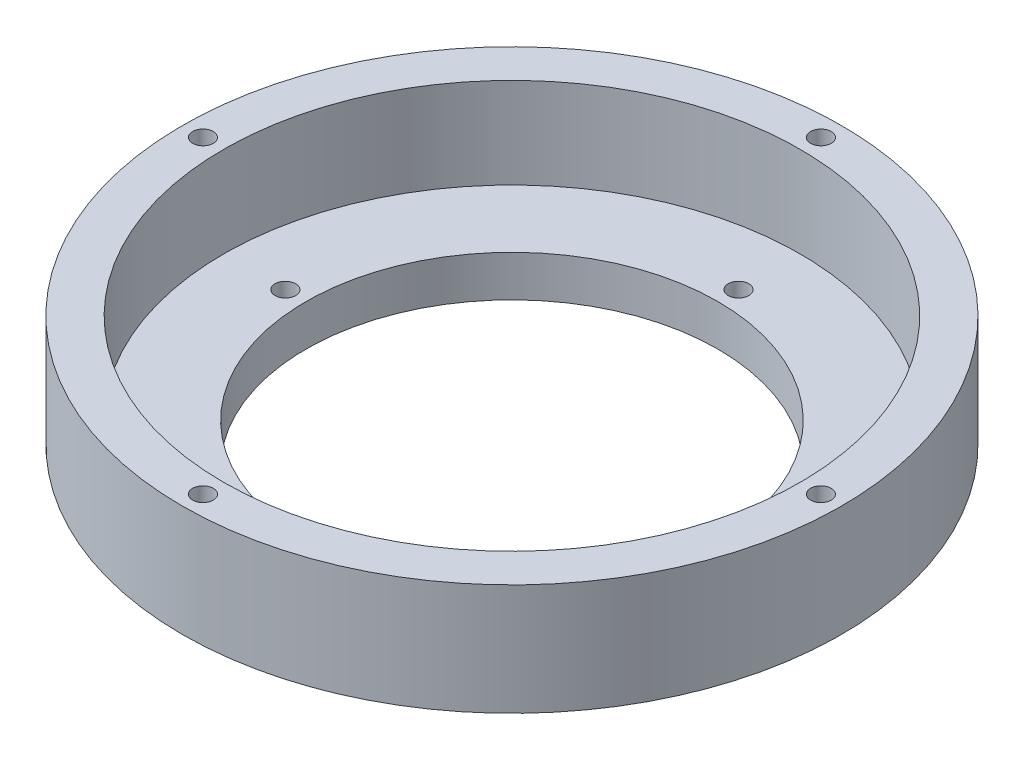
ISO-10303-21;
HEADER;
FILE_DESCRIPTION(('STEP AP214'),'2;1');
FILE_NAME('part.step','',(''),(''),'','','');
FILE_SCHEMA(('AUTOMOTIVE_DESIGN { 1 0 10303 214 1 1 1 1 }'));
ENDSEC;
DATA;
#1=APPLICATION_CONTEXT('core data for automotive mechanical design processes');
#2=APPLICATION_PROTOCOL_DEFINITION('international standard','automotive_design',2000,#1);
#3=PRODUCT_CONTEXT('',#1,'mechanical');
#4=PRODUCT('Part','Part','',(#3));
#5=PRODUCT_RELATED_PRODUCT_CATEGORY('part','',(#4));
#6=PRODUCT_DEFINITION_FORMATION('','',#4);
#7=PRODUCT_DEFINITION_CONTEXT('part definition',#1,'design');
#8=PRODUCT_DEFINITION('design','',#6,#7);
#9=PRODUCT_DEFINITION_SHAPE('','',#8);
#10=(LENGTH_UNIT() NAMED_UNIT(*) SI_UNIT(.MILLI.,.METRE.));
#11=(NAMED_UNIT(*) PLANE_ANGLE_UNIT() SI_UNIT($,.RADIAN.));
#12=(NAMED_UNIT(*) SI_UNIT($,.STERADIAN.) SOLID_ANGLE_UNIT());
#13=UNCERTAINTY_MEASURE_WITH_UNIT(LENGTH_MEASURE(1.E-05),#10,'distance_accuracy_value','');
#14=(GEOMETRIC_REPRESENTATION_CONTEXT(3) GLOBAL_UNCERTAINTY_ASSIGNED_CONTEXT((#13)) GLOBAL_UNIT_ASSIGNED_CONTEXT((#10,
#11,#12)) REPRESENTATION_CONTEXT('',''));
#15=CARTESIAN_POINT('',(0.,0.,0.));
#16=DIRECTION('',(0.,0.,1.));
#17=DIRECTION('',(1.,0.,0.));
#18=AXIS2_PLACEMENT_3D('',#15,#16,#17);
#19=CARTESIAN_POINT('',(0.,10.,0.));
#20=DIRECTION('',(0.,1.,0.));
#21=DIRECTION('',(0.,0.,1.));
#22=AXIS2_PLACEMENT_3D('',#19,#20,#21);
#23=PLANE('',#22);
#24=CARTESIAN_POINT('',(-55.,10.,0.));
#25=DIRECTION('',(0.,1.,0.));
#26=DIRECTION('',(0.,0.,1.));
#27=AXIS2_PLACEMENT_3D('',#24,#25,#26);
#28=CIRCLE('',#27,2.5);
#29=CARTESIAN_POINT('',(-55.,10.,2.5));
#30=VERTEX_POINT('',#29);
#31=EDGE_CURVE('E85',#30,#30,#28,.F.);
#32=ORIENTED_EDGE('',*,*,#31,.T.);
#33=EDGE_LOOP('',(#32));
#34=FACE_BOUND('',#33,.T.);
#35=CARTESIAN_POINT('',(1.94289029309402E-13,10.,55.));
#36=DIRECTION('',(0.,1.,0.));
#37=DIRECTION('',(0.,0.,1.));
#38=AXIS2_PLACEMENT_3D('',#35,#36,#37);
#39=CIRCLE('',#38,2.5);
#40=CARTESIAN_POINT('',(1.94289029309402E-13,10.,57.5));
#41=VERTEX_POINT('',#40);
#42=EDGE_CURVE('E79',#41,#41,#39,.F.);
#43=ORIENTED_EDGE('',*,*,#42,.T.);
#44=EDGE_LOOP('',(#43));
#45=FACE_BOUND('',#44,.T.);
#46=CARTESIAN_POINT('',(-5.759281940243E-13,10.,-55.));
#47=DIRECTION('',(0.,1.,0.));
#48=DIRECTION('',(0.,0.,1.));
#49=AXIS2_PLACEMENT_3D('',#46,#47,#48);
#50=CIRCLE('',#49,2.5);
#51=CARTESIAN_POINT('',(-5.759281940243E-13,10.,-52.5));
#52=VERTEX_POINT('',#51);
#53=EDGE_CURVE('E73',#52,#52,#50,.F.);
#54=ORIENTED_EDGE('',*,*,#53,.T.);
#55=EDGE_LOOP('',(#54));
#56=FACE_BOUND('',#55,.T.);
#57=CARTESIAN_POINT('',(55.,10.,-3.84024409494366E-13));
#58=DIRECTION('',(0.,1.,0.));
#59=DIRECTION('',(0.,0.,1.));
#60=AXIS2_PLACEMENT_3D('',#57,#58,#59);
#61=CIRCLE('',#60,2.5);
#62=CARTESIAN_POINT('',(55.,10.,2.49999999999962));
#63=VERTEX_POINT('',#62);
#64=EDGE_CURVE('E66',#63,#63,#61,.F.);
#65=ORIENTED_EDGE('',*,*,#64,.T.);
#66=EDGE_LOOP('',(#65));
#67=FACE_BOUND('',#66,.T.);
#68=CARTESIAN_POINT('',(0.,10.,0.));
#69=DIRECTION('',(0.,1.,0.));
#70=DIRECTION('',(0.,0.,1.));
#71=AXIS2_PLACEMENT_3D('',#68,#69,#70);
#72=CIRCLE('',#71,50.);
#73=CARTESIAN_POINT('',(0.,10.,50.));
#74=VERTEX_POINT('',#73);
#75=EDGE_CURVE('E56',#74,#74,#72,.T.);
#76=ORIENTED_EDGE('',*,*,#75,.F.);
#77=EDGE_LOOP('',(#76));
#78=FACE_BOUND('',#77,.T.);
#79=CARTESIAN_POINT('',(0.,10.,0.));
#80=DIRECTION('',(0.,1.,0.));
#81=DIRECTION('',(0.,0.,1.));
#82=AXIS2_PLACEMENT_3D('',#79,#80,#81);
#83=CIRCLE('',#82,70.);
#84=CARTESIAN_POINT('',(0.,10.,70.));
#85=VERTEX_POINT('',#84);
#86=EDGE_CURVE('E10',#85,#85,#83,.F.);
#87=ORIENTED_EDGE('',*,*,#86,.F.);
#88=EDGE_LOOP('',(#87));
#89=FACE_BOUND('',#88,.T.);
#90=ADVANCED_FACE('F33',(#34,#45,#56,#67,#78,#89),#23,.T.);
#91=CARTESIAN_POINT('',(0.,0.,0.));
#92=DIRECTION('',(0.,1.,0.));
#93=DIRECTION('',(0.,0.,1.));
#94=AXIS2_PLACEMENT_3D('',#91,#92,#93);
#95=PLANE('',#94);
#96=CARTESIAN_POINT('',(-55.,0.,0.));
#97=DIRECTION('',(0.,-1.,0.));
#98=DIRECTION('',(0.,0.,-1.));
#99=AXIS2_PLACEMENT_3D('',#96,#97,#98);
#100=CIRCLE('',#99,2.5);
#101=CARTESIAN_POINT('',(-55.,0.,-2.5));
#102=VERTEX_POINT('',#101);
#103=EDGE_CURVE('E65',#102,#102,#100,.T.);
#104=ORIENTED_EDGE('',*,*,#103,.F.);
#105=EDGE_LOOP('',(#104));
#106=FACE_BOUND('',#105,.T.);
#107=CARTESIAN_POINT('',(1.94289029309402E-13,0.,55.));
#108=DIRECTION('',(0.,-1.,0.));
#109=DIRECTION('',(0.,0.,-1.));
#110=AXIS2_PLACEMENT_3D('',#107,#108,#109);
#111=CIRCLE('',#110,2.5);
#112=CARTESIAN_POINT('',(1.94289029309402E-13,0.,52.5));
#113=VERTEX_POINT('',#112);
#114=EDGE_CURVE('E82',#113,#113,#111,.T.);
#115=ORIENTED_EDGE('',*,*,#114,.F.);
#116=EDGE_LOOP('',(#115));
#117=FACE_BOUND('',#116,.T.);
#118=CARTESIAN_POINT('',(-5.759281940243E-13,0.,-55.));
#119=DIRECTION('',(0.,-1.,0.));
#120=DIRECTION('',(0.,0.,-1.));
#121=AXIS2_PLACEMENT_3D('',#118,#119,#120);
#122=CIRCLE('',#121,2.5);
#123=CARTESIAN_POINT('',(-5.759281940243E-13,0.,-57.5));
#124=VERTEX_POINT('',#123);
#125=EDGE_CURVE('E76',#124,#124,#122,.T.);
#126=ORIENTED_EDGE('',*,*,#125,.F.);
#127=EDGE_LOOP('',(#126));
#128=FACE_BOUND('',#127,.T.);
#129=CARTESIAN_POINT('',(55.,0.,-3.84024409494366E-13));
#130=DIRECTION('',(0.,-1.,0.));
#131=DIRECTION('',(0.,0.,-1.));
#132=AXIS2_PLACEMENT_3D('',#129,#130,#131);
#133=CIRCLE('',#132,2.5);
#134=CARTESIAN_POINT('',(55.,0.,-2.50000000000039));
#135=VERTEX_POINT('',#134);
#136=EDGE_CURVE('E69',#135,#135,#133,.T.);
#137=ORIENTED_EDGE('',*,*,#136,.F.);
#138=EDGE_LOOP('',(#137));
#139=FACE_BOUND('',#138,.T.);
#140=CARTESIAN_POINT('',(0.,0.,0.));
#141=DIRECTION('',(0.,1.,0.));
#142=DIRECTION('',(0.,0.,1.));
#143=AXIS2_PLACEMENT_3D('',#140,#141,#142);
#144=CIRCLE('',#143,60.);
#145=CARTESIAN_POINT('',(0.,0.,60.));
#146=VERTEX_POINT('',#145);
#147=EDGE_CURVE('E44',#146,#146,#144,.T.);
#148=ORIENTED_EDGE('',*,*,#147,.F.);
#149=EDGE_LOOP('',(#148));
#150=FACE_BOUND('',#149,.T.);
#151=CARTESIAN_POINT('',(0.,0.,0.));
#152=DIRECTION('',(0.,1.,0.));
#153=DIRECTION('',(0.,0.,1.));
#154=AXIS2_PLACEMENT_3D('',#151,#152,#153);
#155=CIRCLE('',#154,50.);
#156=CARTESIAN_POINT('',(0.,0.,50.));
#157=VERTEX_POINT('',#156);
#158=EDGE_CURVE('E49',#157,#157,#155,.T.);
#159=ORIENTED_EDGE('',*,*,#158,.T.);
#160=EDGE_LOOP('',(#159));
#161=FACE_BOUND('',#160,.T.);
#162=ADVANCED_FACE('F149',(#106,#117,#128,#139,#150,#161),#95,.F.);
#163=CARTESIAN_POINT('',(0.,5.,0.));
#164=DIRECTION('',(0.,-1.,0.));
#165=DIRECTION('',(0.,0.,-1.));
#166=AXIS2_PLACEMENT_3D('',#163,#164,#165);
#167=CYLINDRICAL_SURFACE('',#166,60.);
#168=CARTESIAN_POINT('',(0.,5.,0.));
#169=DIRECTION('',(0.,1.,0.));
#170=DIRECTION('',(0.,0.,1.));
#171=AXIS2_PLACEMENT_3D('',#168,#169,#170);
#172=CIRCLE('',#171,60.);
#173=CARTESIAN_POINT('',(0.,5.,60.));
#174=VERTEX_POINT('',#173);
#175=EDGE_CURVE('E40',#174,#174,#172,.T.);
#176=ORIENTED_EDGE('',*,*,#175,.F.);
#177=EDGE_LOOP('',(#176));
#178=FACE_BOUND('',#177,.T.);
#179=ORIENTED_EDGE('',*,*,#147,.T.);
#180=EDGE_LOOP('',(#179));
#181=FACE_BOUND('',#180,.T.);
#182=ADVANCED_FACE('F35',(#178,#181),#167,.T.);
#183=CARTESIAN_POINT('',(0.,5.,0.));
#184=DIRECTION('',(0.,-1.,0.));
#185=DIRECTION('',(0.,0.,-1.));
#186=AXIS2_PLACEMENT_3D('',#183,#184,#185);
#187=CYLINDRICAL_SURFACE('',#186,50.);
#188=ORIENTED_EDGE('',*,*,#158,.F.);
#189=EDGE_LOOP('',(#188));
#190=FACE_BOUND('',#189,.T.);
#191=ORIENTED_EDGE('',*,*,#75,.T.);
#192=EDGE_LOOP('',(#191));
#193=FACE_BOUND('',#192,.T.);
#194=ADVANCED_FACE('F161',(#190,#193),#187,.F.);
#195=CARTESIAN_POINT('',(0.,5.,0.));
#196=DIRECTION('',(0.,1.,0.));
#197=DIRECTION('',(0.,0.,1.));
#198=AXIS2_PLACEMENT_3D('',#195,#196,#197);
#199=PLANE('',#198);
#200=ORIENTED_EDGE('',*,*,#175,.T.);
#201=EDGE_LOOP('',(#200));
#202=FACE_BOUND('',#201,.T.);
#203=CARTESIAN_POINT('',(0.,5.,0.));
#204=DIRECTION('',(0.,1.,0.));
#205=DIRECTION('',(0.,0.,1.));
#206=AXIS2_PLACEMENT_3D('',#203,#204,#205);
#207=CIRCLE('',#206,80.);
#208=CARTESIAN_POINT('',(0.,5.,80.));
#209=VERTEX_POINT('',#208);
#210=EDGE_CURVE('E53',#209,#209,#207,.T.);
#211=ORIENTED_EDGE('',*,*,#210,.F.);
#212=EDGE_LOOP('',(#211));
#213=FACE_BOUND('',#212,.T.);
#214=ADVANCED_FACE('F158',(#202,#213),#199,.F.);
#215=CARTESIAN_POINT('',(0.,10.,0.));
#216=DIRECTION('',(0.,-1.,0.));
#217=DIRECTION('',(0.,0.,-1.));
#218=AXIS2_PLACEMENT_3D('',#215,#216,#217);
#219=CYLINDRICAL_SURFACE('',#218,80.);
#220=ORIENTED_EDGE('',*,*,#210,.T.);
#221=EDGE_LOOP('',(#220));
#222=FACE_BOUND('',#221,.T.);
#223=CARTESIAN_POINT('',(0.,32.,0.));
#224=DIRECTION('',(0.,1.,0.));
#225=DIRECTION('',(0.,0.,1.));
#226=AXIS2_PLACEMENT_3D('',#223,#224,#225);
#227=CIRCLE('',#226,80.);
#228=CARTESIAN_POINT('',(0.,32.,80.));
#229=VERTEX_POINT('',#228);
#230=EDGE_CURVE('E59',#229,#229,#227,.T.);
#231=ORIENTED_EDGE('',*,*,#230,.F.);
#232=EDGE_LOOP('',(#231));
#233=FACE_BOUND('',#232,.T.);
#234=ADVANCED_FACE('F127',(#222,#233),#219,.T.);
#235=CARTESIAN_POINT('',(0.,32.,0.));
#236=DIRECTION('',(0.,1.,0.));
#237=DIRECTION('',(0.,0.,1.));
#238=AXIS2_PLACEMENT_3D('',#235,#236,#237);
#239=PLANE('',#238);
#240=CARTESIAN_POINT('',(-75.,32.,0.));
#241=DIRECTION('',(0.,1.,0.));
#242=DIRECTION('',(0.,0.,1.));
#243=AXIS2_PLACEMENT_3D('',#240,#241,#242);
#244=CIRCLE('',#243,2.5);
#245=CARTESIAN_POINT('',(-75.,32.,2.5));
#246=VERTEX_POINT('',#245);
#247=EDGE_CURVE('E108',#246,#246,#244,.T.);
#248=ORIENTED_EDGE('',*,*,#247,.F.);
#249=EDGE_LOOP('',(#248));
#250=FACE_BOUND('',#249,.T.);
#251=CARTESIAN_POINT('',(0.,32.,-75.));
#252=DIRECTION('',(0.,1.,0.));
#253=DIRECTION('',(0.,0.,1.));
#254=AXIS2_PLACEMENT_3D('',#251,#252,#253);
#255=CIRCLE('',#254,2.5);
#256=CARTESIAN_POINT('',(0.,32.,-72.5));
#257=VERTEX_POINT('',#256);
#258=EDGE_CURVE('E102',#257,#257,#255,.T.);
#259=ORIENTED_EDGE('',*,*,#258,.F.);
#260=EDGE_LOOP('',(#259));
#261=FACE_BOUND('',#260,.T.);
#262=CARTESIAN_POINT('',(0.,32.,75.));
#263=DIRECTION('',(0.,1.,0.));
#264=DIRECTION('',(0.,0.,1.));
#265=AXIS2_PLACEMENT_3D('',#262,#263,#264);
#266=CIRCLE('',#265,2.5);
#267=CARTESIAN_POINT('',(0.,32.,77.5));
#268=VERTEX_POINT('',#267);
#269=EDGE_CURVE('E96',#268,#268,#266,.T.);
#270=ORIENTED_EDGE('',*,*,#269,.F.);
#271=EDGE_LOOP('',(#270));
#272=FACE_BOUND('',#271,.T.);
#273=CARTESIAN_POINT('',(75.,32.,0.));
#274=DIRECTION('',(0.,1.,0.));
#275=DIRECTION('',(0.,0.,1.));
#276=AXIS2_PLACEMENT_3D('',#273,#274,#275);
#277=CIRCLE('',#276,2.5);
#278=CARTESIAN_POINT('',(75.,32.,2.5));
#279=VERTEX_POINT('',#278);
#280=EDGE_CURVE('E90',#279,#279,#277,.T.);
#281=ORIENTED_EDGE('',*,*,#280,.F.);
#282=EDGE_LOOP('',(#281));
#283=FACE_BOUND('',#282,.T.);
#284=ORIENTED_EDGE('',*,*,#230,.T.);
#285=EDGE_LOOP('',(#284));
#286=FACE_BOUND('',#285,.T.);
#287=CARTESIAN_POINT('',(0.,32.,0.));
#288=DIRECTION('',(0.,1.,0.));
#289=DIRECTION('',(0.,0.,1.));
#290=AXIS2_PLACEMENT_3D('',#287,#288,#289);
#291=CIRCLE('',#290,70.);
#292=CARTESIAN_POINT('',(0.,32.,70.));
#293=VERTEX_POINT('',#292);
#294=EDGE_CURVE('E62',#293,#293,#291,.T.);
#295=ORIENTED_EDGE('',*,*,#294,.F.);
#296=EDGE_LOOP('',(#295));
#297=FACE_BOUND('',#296,.T.);
#298=ADVANCED_FACE('F123',(#250,#261,#272,#283,#286,#297),#239,.T.);
#299=CARTESIAN_POINT('',(0.,32.,0.));
#300=DIRECTION('',(0.,-1.,0.));
#301=DIRECTION('',(0.,0.,-1.));
#302=AXIS2_PLACEMENT_3D('',#299,#300,#301);
#303=CYLINDRICAL_SURFACE('',#302,70.);
#304=ORIENTED_EDGE('',*,*,#294,.T.);
#305=EDGE_LOOP('',(#304));
#306=FACE_BOUND('',#305,.T.);
#307=ORIENTED_EDGE('',*,*,#86,.T.);
#308=EDGE_LOOP('',(#307));
#309=FACE_BOUND('',#308,.T.);
#310=ADVANCED_FACE('F126',(#306,#309),#303,.F.);
#311=CARTESIAN_POINT('',(55.,32.001,-3.84024409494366E-13));
#312=DIRECTION('',(0.,-1.,0.));
#313=DIRECTION('',(0.,0.,-1.));
#314=AXIS2_PLACEMENT_3D('',#311,#312,#313);
#315=CYLINDRICAL_SURFACE('',#314,2.5);
#316=ORIENTED_EDGE('',*,*,#64,.F.);
#317=EDGE_LOOP('',(#316));
#318=FACE_BOUND('',#317,.T.);
#319=ORIENTED_EDGE('',*,*,#136,.T.);
#320=EDGE_LOOP('',(#319));
#321=FACE_BOUND('',#320,.T.);
#322=ADVANCED_FACE('F140',(#318,#321),#315,.F.);
#323=CARTESIAN_POINT('',(-5.759281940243E-13,32.001,-55.));
#324=DIRECTION('',(0.,-1.,0.));
#325=DIRECTION('',(0.,0.,-1.));
#326=AXIS2_PLACEMENT_3D('',#323,#324,#325);
#327=CYLINDRICAL_SURFACE('',#326,2.5);
#328=ORIENTED_EDGE('',*,*,#53,.F.);
#329=EDGE_LOOP('',(#328));
#330=FACE_BOUND('',#329,.T.);
#331=ORIENTED_EDGE('',*,*,#125,.T.);
#332=EDGE_LOOP('',(#331));
#333=FACE_BOUND('',#332,.T.);
#334=ADVANCED_FACE('F145',(#330,#333),#327,.F.);
#335=CARTESIAN_POINT('',(1.94289029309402E-13,32.001,55.));
#336=DIRECTION('',(0.,-1.,0.));
#337=DIRECTION('',(0.,0.,-1.));
#338=AXIS2_PLACEMENT_3D('',#335,#336,#337);
#339=CYLINDRICAL_SURFACE('',#338,2.5);
#340=ORIENTED_EDGE('',*,*,#42,.F.);
#341=EDGE_LOOP('',(#340));
#342=FACE_BOUND('',#341,.T.);
#343=ORIENTED_EDGE('',*,*,#114,.T.);
#344=EDGE_LOOP('',(#343));
#345=FACE_BOUND('',#344,.T.);
#346=ADVANCED_FACE('F204',(#342,#345),#339,.F.);
#347=CARTESIAN_POINT('',(-55.,32.001,0.));
#348=DIRECTION('',(0.,-1.,0.));
#349=DIRECTION('',(0.,0.,-1.));
#350=AXIS2_PLACEMENT_3D('',#347,#348,#349);
#351=CYLINDRICAL_SURFACE('',#350,2.5);
#352=ORIENTED_EDGE('',*,*,#31,.F.);
#353=EDGE_LOOP('',(#352));
#354=FACE_BOUND('',#353,.T.);
#355=ORIENTED_EDGE('',*,*,#103,.T.);
#356=EDGE_LOOP('',(#355));
#357=FACE_BOUND('',#356,.T.);
#358=ADVANCED_FACE('F214',(#354,#357),#351,.F.);
#359=CARTESIAN_POINT('',(75.,22.,0.));
#360=DIRECTION('',(0.,1.,0.));
#361=DIRECTION('',(0.,0.,1.));
#362=AXIS2_PLACEMENT_3D('',#359,#360,#361);
#363=CYLINDRICAL_SURFACE('',#362,2.5);
#364=CARTESIAN_POINT('',(75.,22.,0.));
#365=DIRECTION('',(0.,1.,0.));
#366=DIRECTION('',(0.,0.,1.));
#367=AXIS2_PLACEMENT_3D('',#364,#365,#366);
#368=CIRCLE('',#367,2.5);
#369=CARTESIAN_POINT('',(75.,22.,2.5));
#370=VERTEX_POINT('',#369);
#371=EDGE_CURVE('E93',#370,#370,#368,.T.);
#372=ORIENTED_EDGE('',*,*,#371,.F.);
#373=EDGE_LOOP('',(#372));
#374=FACE_BOUND('',#373,.T.);
#375=ORIENTED_EDGE('',*,*,#280,.T.);
#376=EDGE_LOOP('',(#375));
#377=FACE_BOUND('',#376,.T.);
#378=ADVANCED_FACE('F224',(#374,#377),#363,.F.);
#379=CARTESIAN_POINT('',(75.,22.,0.));
#380=DIRECTION('',(0.,1.,0.));
#381=DIRECTION('',(0.,0.,1.));
#382=AXIS2_PLACEMENT_3D('',#379,#380,#381);
#383=PLANE('',#382);
#384=ORIENTED_EDGE('',*,*,#371,.T.);
#385=EDGE_LOOP('',(#384));
#386=FACE_BOUND('',#385,.T.);
#387=ADVANCED_FACE('F241',(#386),#383,.T.);
#388=CARTESIAN_POINT('',(0.,22.,75.));
#389=DIRECTION('',(0.,1.,0.));
#390=DIRECTION('',(0.,0.,1.));
#391=AXIS2_PLACEMENT_3D('',#388,#389,#390);
#392=CYLINDRICAL_SURFACE('',#391,2.5);
#393=CARTESIAN_POINT('',(0.,22.,75.));
#394=DIRECTION('',(0.,1.,0.));
#395=DIRECTION('',(0.,0.,1.));
#396=AXIS2_PLACEMENT_3D('',#393,#394,#395);
#397=CIRCLE('',#396,2.5);
#398=CARTESIAN_POINT('',(0.,22.,77.5));
#399=VERTEX_POINT('',#398);
#400=EDGE_CURVE('E99',#399,#399,#397,.T.);
#401=ORIENTED_EDGE('',*,*,#400,.F.);
#402=EDGE_LOOP('',(#401));
#403=FACE_BOUND('',#402,.T.);
#404=ORIENTED_EDGE('',*,*,#269,.T.);
#405=EDGE_LOOP('',(#404));
#406=FACE_BOUND('',#405,.T.);
#407=ADVANCED_FACE('F251',(#403,#406),#392,.F.);
#408=CARTESIAN_POINT('',(0.,22.,75.));
#409=DIRECTION('',(0.,1.,0.));
#410=DIRECTION('',(0.,0.,1.));
#411=AXIS2_PLACEMENT_3D('',#408,#409,#410);
#412=PLANE('',#411);
#413=ORIENTED_EDGE('',*,*,#400,.T.);
#414=EDGE_LOOP('',(#413));
#415=FACE_BOUND('',#414,.T.);
#416=ADVANCED_FACE('F261',(#415),#412,.T.);
#417=CARTESIAN_POINT('',(0.,22.,-75.));
#418=DIRECTION('',(0.,1.,0.));
#419=DIRECTION('',(0.,0.,1.));
#420=AXIS2_PLACEMENT_3D('',#417,#418,#419);
#421=CYLINDRICAL_SURFACE('',#420,2.5);
#422=CARTESIAN_POINT('',(0.,22.,-75.));
#423=DIRECTION('',(0.,1.,0.));
#424=DIRECTION('',(0.,0.,1.));
#425=AXIS2_PLACEMENT_3D('',#422,#423,#424);
#426=CIRCLE('',#425,2.5);
#427=CARTESIAN_POINT('',(0.,22.,-72.5));
#428=VERTEX_POINT('',#427);
#429=EDGE_CURVE('E105',#428,#428,#426,.T.);
#430=ORIENTED_EDGE('',*,*,#429,.F.);
#431=EDGE_LOOP('',(#430));
#432=FACE_BOUND('',#431,.T.);
#433=ORIENTED_EDGE('',*,*,#258,.T.);
#434=EDGE_LOOP('',(#433));
#435=FACE_BOUND('',#434,.T.);
#436=ADVANCED_FACE('F271',(#432,#435),#421,.F.);
#437=CARTESIAN_POINT('',(0.,22.,-75.));
#438=DIRECTION('',(0.,1.,0.));
#439=DIRECTION('',(0.,0.,1.));
#440=AXIS2_PLACEMENT_3D('',#437,#438,#439);
#441=PLANE('',#440);
#442=ORIENTED_EDGE('',*,*,#429,.T.);
#443=EDGE_LOOP('',(#442));
#444=FACE_BOUND('',#443,.T.);
#445=ADVANCED_FACE('F119',(#444),#441,.T.);
#446=CARTESIAN_POINT('',(-75.,22.,0.));
#447=DIRECTION('',(0.,1.,0.));
#448=DIRECTION('',(0.,0.,1.));
#449=AXIS2_PLACEMENT_3D('',#446,#447,#448);
#450=CYLINDRICAL_SURFACE('',#449,2.5);
#451=CARTESIAN_POINT('',(-75.,22.,0.));
#452=DIRECTION('',(0.,1.,0.));
#453=DIRECTION('',(0.,0.,1.));
#454=AXIS2_PLACEMENT_3D('',#451,#452,#453);
#455=CIRCLE('',#454,2.5);
#456=CARTESIAN_POINT('',(-75.,22.,2.5));
#457=VERTEX_POINT('',#456);
#458=EDGE_CURVE('E70',#457,#457,#455,.T.);
#459=ORIENTED_EDGE('',*,*,#458,.F.);
#460=EDGE_LOOP('',(#459));
#461=FACE_BOUND('',#460,.T.);
#462=ORIENTED_EDGE('',*,*,#247,.T.);
#463=EDGE_LOOP('',(#462));
#464=FACE_BOUND('',#463,.T.);
#465=ADVANCED_FACE('F116',(#461,#464),#450,.F.);
#466=CARTESIAN_POINT('',(-75.,22.,0.));
#467=DIRECTION('',(0.,1.,0.));
#468=DIRECTION('',(0.,0.,1.));
#469=AXIS2_PLACEMENT_3D('',#466,#467,#468);
#470=PLANE('',#469);
#471=ORIENTED_EDGE('',*,*,#458,.T.);
#472=EDGE_LOOP('',(#471));
#473=FACE_BOUND('',#472,.T.);
#474=ADVANCED_FACE('F114',(#473),#470,.T.);
#475=CLOSED_SHELL('',(#90,#162,#182,#194,#214,#234,#298,#310,#322,#334,#346,#358,#378,#387,#407,
#416,#436,#445,#465,#474));
#476=MANIFOLD_SOLID_BREP('B2',#475);
#477=ADVANCED_BREP_SHAPE_REPRESENTATION('',(#18,#476),#14);
#478=SHAPE_DEFINITION_REPRESENTATION(#9,#477);
ENDSEC;
END-ISO-10303-21;
